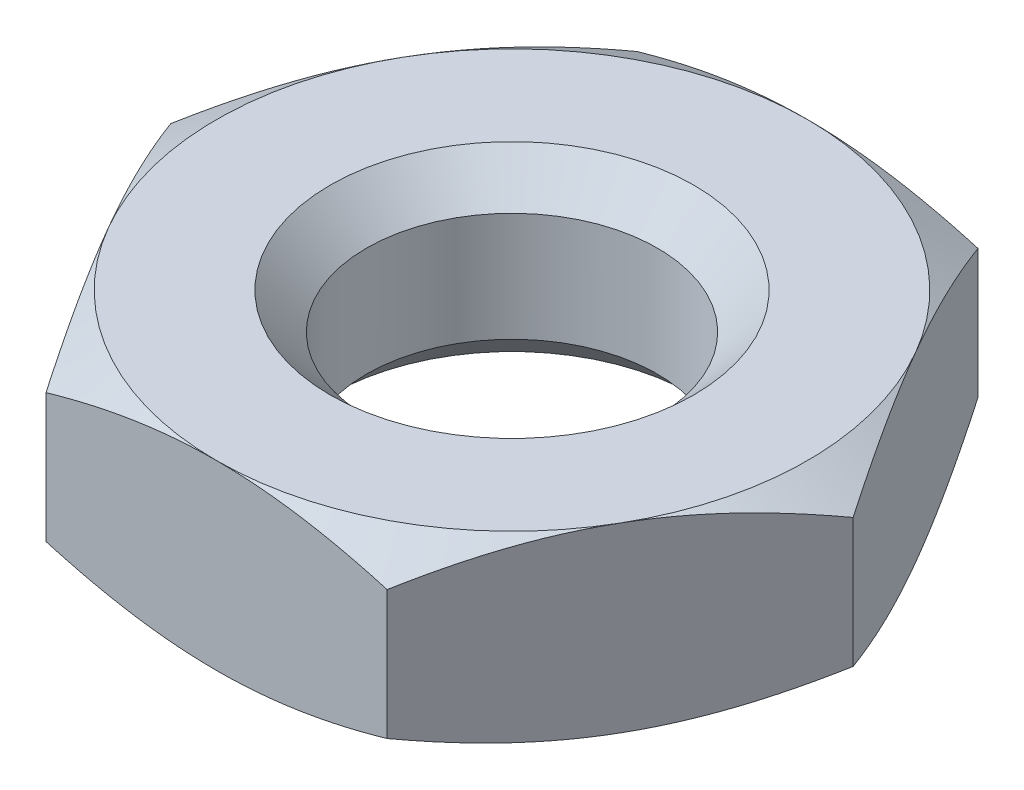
ISO-10303-21;
HEADER;
FILE_DESCRIPTION(('STEP AP214'),'2;1');
FILE_NAME('part.step','',(''),(''),'','','');
FILE_SCHEMA(('AUTOMOTIVE_DESIGN { 1 0 10303 214 1 1 1 1 }'));
ENDSEC;
DATA;
#1=APPLICATION_CONTEXT('core data for automotive mechanical design processes');
#2=APPLICATION_PROTOCOL_DEFINITION('international standard','automotive_design',2000,#1);
#3=PRODUCT_CONTEXT('',#1,'mechanical');
#4=PRODUCT('Part','Part','',(#3));
#5=PRODUCT_RELATED_PRODUCT_CATEGORY('part','',(#4));
#6=PRODUCT_DEFINITION_FORMATION('','',#4);
#7=PRODUCT_DEFINITION_CONTEXT('part definition',#1,'design');
#8=PRODUCT_DEFINITION('design','',#6,#7);
#9=PRODUCT_DEFINITION_SHAPE('','',#8);
#10=(LENGTH_UNIT() NAMED_UNIT(*) SI_UNIT(.MILLI.,.METRE.));
#11=(NAMED_UNIT(*) PLANE_ANGLE_UNIT() SI_UNIT($,.RADIAN.));
#12=(NAMED_UNIT(*) SI_UNIT($,.STERADIAN.) SOLID_ANGLE_UNIT());
#13=UNCERTAINTY_MEASURE_WITH_UNIT(LENGTH_MEASURE(1.E-05),#10,'distance_accuracy_value','');
#14=(GEOMETRIC_REPRESENTATION_CONTEXT(3) GLOBAL_UNCERTAINTY_ASSIGNED_CONTEXT((#13)) GLOBAL_UNIT_ASSIGNED_CONTEXT((#10,
#11,#12)) REPRESENTATION_CONTEXT('',''));
#15=CARTESIAN_POINT('',(0.,0.,0.));
#16=DIRECTION('',(0.,0.,1.));
#17=DIRECTION('',(1.,0.,0.));
#18=AXIS2_PLACEMENT_3D('',#15,#16,#17);
#19=CARTESIAN_POINT('',(0.,0.,0.));
#20=DIRECTION('',(0.,1.,0.));
#21=DIRECTION('',(-1.,0.,0.));
#22=AXIS2_PLACEMENT_3D('',#19,#20,#21);
#23=CONICAL_SURFACE('',#22,6.5,1.04719754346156);
#24=CARTESIAN_POINT('',(7.50566896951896,0.580623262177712,0.000200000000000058));
#25=CARTESIAN_POINT('',(7.42317862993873,0.533004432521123,-0.14267745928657));
#26=CARTESIAN_POINT('',(7.34038072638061,0.487546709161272,-0.286087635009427));
#27=CARTESIAN_POINT('',(7.17411251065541,0.401548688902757,-0.57407263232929));
#28=CARTESIAN_POINT('',(7.09064192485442,0.361010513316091,-0.718647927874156));
#29=CARTESIAN_POINT('',(6.83889369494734,0.247571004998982,-1.15468865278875));
#30=CARTESIAN_POINT('',(6.66962231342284,0.183047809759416,-1.44787528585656));
#31=CARTESIAN_POINT('',(6.41631076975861,0.107386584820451,-1.8866237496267));
#32=CARTESIAN_POINT('',(6.33302747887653,0.0858328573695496,-2.03087464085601));
#33=CARTESIAN_POINT('',(6.16608458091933,0.0496903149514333,-2.32002822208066));
#34=CARTESIAN_POINT('',(6.08242500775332,0.0351008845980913,-2.46493085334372));
#35=CARTESIAN_POINT('',(5.91496056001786,0.0132587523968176,-2.754987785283));
#36=CARTESIAN_POINT('',(5.83115595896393,0.00599772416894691,-2.90014161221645));
#37=CARTESIAN_POINT('',(5.66347396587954,-0.00103969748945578,-3.19057534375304));
#38=CARTESIAN_POINT('',(5.57959657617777,-0.000816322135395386,-3.33585524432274));
#39=CARTESIAN_POINT('',(5.34979921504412,0.0100834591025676,-3.73387594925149));
#40=CARTESIAN_POINT('',(5.20395446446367,0.0283818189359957,-3.98648646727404));
#41=CARTESIAN_POINT('',(4.91323365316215,0.0864063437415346,-4.49002968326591));
#42=CARTESIAN_POINT('',(4.76835861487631,0.126152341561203,-4.74096061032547));
#43=CARTESIAN_POINT('',(4.47705271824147,0.225505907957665,-5.24551722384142));
#44=CARTESIAN_POINT('',(4.33065861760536,0.285534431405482,-5.49907924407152));
#45=CARTESIAN_POINT('',(4.04005357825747,0.421775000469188,-6.00242193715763));
#46=CARTESIAN_POINT('',(3.89583891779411,0.497955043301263,-6.25220905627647));
#47=CARTESIAN_POINT('',(3.75266127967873,0.580623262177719,-6.5002));
#48=B_SPLINE_CURVE_WITH_KNOTS('',3,(#24,#25,#26,#27,#28,#29,#30,#31,#32,#33,#34,#35,#36,#37,#38,
#39,#40,#41,#42,#43,#44,#45,#46,#47),.UNSPECIFIED.,.F.,.F.,(4,2,2,2,2,2,2,2,2,2,2,4),(0.,
0.515105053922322,1.03043143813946,2.06322555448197,2.56697390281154,3.0706777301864,
3.57380861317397,4.0769239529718,4.95279355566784,5.82947447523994,6.72559912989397,
7.61996451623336),.UNSPECIFIED.);
#49=CARTESIAN_POINT('',(7.50555349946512,0.580556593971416,0.));
#50=VERTEX_POINT('',#49);
#51=CARTESIAN_POINT('',(5.62916512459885,0.,-3.24999999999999));
#52=VERTEX_POINT('',#51);
#53=EDGE_CURVE('E287',#50,#52,#48,.T.);
#54=ORIENTED_EDGE('',*,*,#53,.F.);
#55=CARTESIAN_POINT('',(3.75266127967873,0.580623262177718,6.5002));
#56=CARTESIAN_POINT('',(3.83515161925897,0.533004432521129,6.35732254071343));
#57=CARTESIAN_POINT('',(3.91794952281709,0.487546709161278,6.21391236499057));
#58=CARTESIAN_POINT('',(4.08421773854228,0.401548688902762,5.92592736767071));
#59=CARTESIAN_POINT('',(4.16768832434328,0.361010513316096,5.78135207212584));
#60=CARTESIAN_POINT('',(4.41943655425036,0.247571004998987,5.34531134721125));
#61=CARTESIAN_POINT('',(4.58870793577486,0.183047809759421,5.05212471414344));
#62=CARTESIAN_POINT('',(4.84201947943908,0.107386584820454,4.6133762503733));
#63=CARTESIAN_POINT('',(4.92530277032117,0.0858328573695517,4.46912535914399));
#64=CARTESIAN_POINT('',(5.09224566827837,0.0496903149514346,4.17997177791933));
#65=CARTESIAN_POINT('',(5.17590524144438,0.0351008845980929,4.03506914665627));
#66=CARTESIAN_POINT('',(5.34336968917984,0.013258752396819,3.74501221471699));
#67=CARTESIAN_POINT('',(5.42717429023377,0.00599772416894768,3.59985838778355));
#68=CARTESIAN_POINT('',(5.59485628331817,-0.0010396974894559,3.30942465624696));
#69=CARTESIAN_POINT('',(5.67873367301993,-0.000816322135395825,3.16414475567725));
#70=CARTESIAN_POINT('',(5.90853103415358,0.0100834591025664,2.76612405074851));
#71=CARTESIAN_POINT('',(6.05437578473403,0.0283818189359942,2.51351353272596));
#72=CARTESIAN_POINT('',(6.34509659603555,0.0864063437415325,2.00997031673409));
#73=CARTESIAN_POINT('',(6.48997163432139,0.1261523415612,1.75903938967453));
#74=CARTESIAN_POINT('',(6.78127753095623,0.225505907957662,1.25448277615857));
#75=CARTESIAN_POINT('',(6.92767163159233,0.285534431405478,1.00092075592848));
#76=CARTESIAN_POINT('',(7.21827667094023,0.421775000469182,0.49757806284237));
#77=CARTESIAN_POINT('',(7.36249133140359,0.497955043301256,0.247790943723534));
#78=CARTESIAN_POINT('',(7.50566896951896,0.580623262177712,-0.00020000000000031));
#79=B_SPLINE_CURVE_WITH_KNOTS('',3,(#55,#56,#57,#58,#59,#60,#61,#62,#63,#64,#65,#66,#67,#68,#69,
#70,#71,#72,#73,#74,#75,#76,#77,#78),.UNSPECIFIED.,.F.,.F.,(4,2,2,2,2,2,2,2,2,2,2,4),(0.,
0.515105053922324,1.03043143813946,2.06322555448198,2.56697390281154,3.07067773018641,
3.57380861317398,4.07692395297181,4.95279355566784,5.82947447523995,6.72559912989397,
7.61996451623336),.UNSPECIFIED.);
#80=CARTESIAN_POINT('',(5.62916512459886,0.,3.24999999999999));
#81=VERTEX_POINT('',#80);
#82=EDGE_CURVE('E157',#81,#50,#79,.T.);
#83=ORIENTED_EDGE('',*,*,#82,.F.);
#84=CARTESIAN_POINT('',(0.,0.,0.));
#85=DIRECTION('',(0.,1.,0.));
#86=DIRECTION('',(-1.,0.,0.));
#87=AXIS2_PLACEMENT_3D('',#84,#85,#86);
#88=CIRCLE('',#87,6.5);
#89=EDGE_CURVE('E263',#81,#52,#88,.T.);
#90=ORIENTED_EDGE('',*,*,#89,.T.);
#91=EDGE_LOOP('',(#54,#83,#90));
#92=FACE_BOUND('',#91,.T.);
#93=ADVANCED_FACE('F37',(#92),#23,.T.);
#94=CARTESIAN_POINT('',(3.75277674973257,0.580556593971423,-6.5));
#95=VERTEX_POINT('',#94);
#96=EDGE_CURVE('E291',#52,#95,#48,.T.);
#97=ORIENTED_EDGE('',*,*,#96,.F.);
#98=CARTESIAN_POINT('',(0.,0.,-6.5));
#99=VERTEX_POINT('',#98);
#100=EDGE_CURVE('E279',#52,#99,#88,.T.);
#101=ORIENTED_EDGE('',*,*,#100,.T.);
#102=CARTESIAN_POINT('',(-10.0886341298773,3.17616114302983,-6.5));
#103=CARTESIAN_POINT('',(-9.80467347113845,3.03838174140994,-6.5));
#104=CARTESIAN_POINT('',(-9.52006185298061,2.90192102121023,-6.5));
#105=CARTESIAN_POINT('',(-8.94919057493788,2.63237840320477,-6.5));
#106=CARTESIAN_POINT('',(-8.66293066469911,2.49929703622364,-6.5));
#107=CARTESIAN_POINT('',(-8.08694567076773,2.23658679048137,-6.5));
#108=CARTESIAN_POINT('',(-7.79721021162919,2.10698058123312,-6.5));
#109=CARTESIAN_POINT('',(-7.21543776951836,1.85306089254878,-6.5));
#110=CARTESIAN_POINT('',(-6.92340089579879,1.72874716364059,-6.5));
#111=CARTESIAN_POINT('',(-6.32709030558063,1.48290474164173,-6.5));
#112=CARTESIAN_POINT('',(-6.02272573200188,1.36159523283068,-6.5));
#113=CARTESIAN_POINT('',(-5.41043841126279,1.12813757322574,-6.5));
#114=CARTESIAN_POINT('',(-5.10251526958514,1.01599044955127,-6.5));
#115=CARTESIAN_POINT('',(-4.48319586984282,0.803795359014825,-6.5));
#116=CARTESIAN_POINT('',(-4.17180806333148,0.703722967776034,-6.5));
#117=CARTESIAN_POINT('',(-3.54456226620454,0.518884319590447,-6.5));
#118=CARTESIAN_POINT('',(-3.22870571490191,0.43411325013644,-6.5));
#119=CARTESIAN_POINT('',(-2.59412088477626,0.284389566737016,-6.5));
#120=CARTESIAN_POINT('',(-2.27541854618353,0.219328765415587,-6.5));
#121=CARTESIAN_POINT('',(-1.6339965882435,0.112709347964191,-6.5));
#122=CARTESIAN_POINT('',(-1.31127735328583,0.0711485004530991,-6.5));
#123=CARTESIAN_POINT('',(-0.827615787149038,0.0291913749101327,-6.5));
#124=CARTESIAN_POINT('',(-0.667517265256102,0.0186073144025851,-6.5));
#125=CARTESIAN_POINT('',(-0.347008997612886,0.0042135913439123,-6.5));
#126=CARTESIAN_POINT('',(-0.186599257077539,0.000403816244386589,-6.5));
#127=CARTESIAN_POINT('',(0.134235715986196,-0.000342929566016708,-6.5));
#128=CARTESIAN_POINT('',(0.294660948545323,0.00272011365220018,-6.5));
#129=CARTESIAN_POINT('',(0.615239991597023,0.0156420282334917,-6.5));
#130=CARTESIAN_POINT('',(0.775393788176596,0.0255012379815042,-6.5));
#131=CARTESIAN_POINT('',(1.16005135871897,0.0571346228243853,-6.5));
#132=CARTESIAN_POINT('',(1.38429656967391,0.0821202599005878,-6.5));
#133=CARTESIAN_POINT('',(1.83111748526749,0.144054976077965,-6.5));
#134=CARTESIAN_POINT('',(2.05369295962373,0.181005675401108,-6.5));
#135=CARTESIAN_POINT('',(2.71866392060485,0.307845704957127,-6.5));
#136=CARTESIAN_POINT('',(3.15805420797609,0.413699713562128,-6.5));
#137=CARTESIAN_POINT('',(3.81504917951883,0.597194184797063,-6.5));
#138=CARTESIAN_POINT('',(4.03606361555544,0.663327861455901,-6.5));
#139=CARTESIAN_POINT('',(4.47594587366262,0.802449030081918,-6.5));
#140=CARTESIAN_POINT('',(4.69481368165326,0.875436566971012,-6.5));
#141=CARTESIAN_POINT('',(5.13047157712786,1.02709568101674,-6.5));
#142=CARTESIAN_POINT('',(5.34726232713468,1.10576537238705,-6.5));
#143=CARTESIAN_POINT('',(5.77904891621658,1.26786470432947,-6.5));
#144=CARTESIAN_POINT('',(5.99404477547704,1.35129429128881,-6.5));
#145=CARTESIAN_POINT('',(6.49787787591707,1.55220480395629,-6.5));
#146=CARTESIAN_POINT('',(6.78605773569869,1.67133113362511,-6.5));
#147=CARTESIAN_POINT('',(7.35998859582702,1.9153142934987,-6.5));
#148=CARTESIAN_POINT('',(7.64573945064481,2.04017146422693,-6.5));
#149=CARTESIAN_POINT('',(8.21525357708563,2.29447640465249,-6.5));
#150=CARTESIAN_POINT('',(8.49901644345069,2.42392507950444,-6.5));
#151=CARTESIAN_POINT('',(9.06483728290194,2.68650288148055,-6.5));
#152=CARTESIAN_POINT('',(9.34689521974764,2.81963208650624,-6.5));
#153=CARTESIAN_POINT('',(9.90987348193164,3.0890251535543,-6.5));
#154=CARTESIAN_POINT('',(10.1907922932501,3.22529217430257,-6.5));
#155=CARTESIAN_POINT('',(10.7514192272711,3.50029662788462,-6.5));
#156=CARTESIAN_POINT('',(11.0311273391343,3.63903408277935,-6.5));
#157=CARTESIAN_POINT('',(11.868649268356,4.05826371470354,-6.5));
#158=CARTESIAN_POINT('',(12.4249347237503,4.34180888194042,-6.5));
#159=CARTESIAN_POINT('',(13.4885089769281,4.89087824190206,-6.5));
#160=CARTESIAN_POINT('',(13.9960343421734,5.15594623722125,-6.5));
#161=CARTESIAN_POINT('',(15.0091848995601,5.68972878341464,-6.5));
#162=CARTESIAN_POINT('',(15.5148100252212,5.95844346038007,-6.5));
#163=CARTESIAN_POINT('',(16.5233283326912,6.49798637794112,-6.5));
#164=CARTESIAN_POINT('',(17.0262251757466,6.76880778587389,-6.5));
#165=CARTESIAN_POINT('',(18.0308016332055,7.31263450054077,-6.5));
#166=CARTESIAN_POINT('',(18.5324813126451,7.58563968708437,-6.5));
#167=CARTESIAN_POINT('',(19.0337120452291,7.85946110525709,-6.5));
#168=B_SPLINE_CURVE_WITH_KNOTS('',3,(#102,#103,#104,#105,#106,#107,#108,#109,#110,#111,#112,
#113,#114,#115,#116,#117,#118,#119,#120,#121,#122,#123,#124,#125,#126,#127,#128,#129,#130,#131,
#132,#133,#134,#135,#136,#137,#138,#139,#140,#141,#142,#143,#144,#145,#146,#147,#148,#149,#150,
#151,#152,#153,#154,#155,#156,#157,#158,#159,#160,#161,#162,#163,#164,#165,#166,#167),
.UNSPECIFIED.,.F.,.F.,(4,2,2,2,2,2,2,2,2,2,2,2,2,2,2,2,2,2,2,2,2,2,2,2,2,2,2,2,2,2,2,2,4),(0.,
0.946875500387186,1.89389882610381,2.84606421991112,3.7981846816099,4.78101744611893,
5.76396023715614,6.74488019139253,7.72549109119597,8.70061771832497,9.67565173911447,
10.1568741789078,10.6380886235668,11.1193040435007,11.6005434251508,12.2770600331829,
12.9536682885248,14.3076338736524,14.9996668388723,15.691704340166,16.3835132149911,
17.0753142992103,18.0107248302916,18.9461910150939,19.8818426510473,20.8175141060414,
21.754172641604,22.6908395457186,24.5639267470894,26.2816383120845,27.9994094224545,
29.7129512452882,31.4263993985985),.UNSPECIFIED.);
#169=EDGE_CURVE('E343',#95,#99,#168,.F.);
#170=ORIENTED_EDGE('',*,*,#169,.F.);
#171=EDGE_LOOP('',(#97,#101,#170));
#172=FACE_BOUND('',#171,.T.);
#173=ADVANCED_FACE('F317',(#172),#23,.T.);
#174=CARTESIAN_POINT('',(-3.75277674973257,0.580556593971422,-6.5));
#175=VERTEX_POINT('',#174);
#176=EDGE_CURVE('E215',#99,#175,#168,.F.);
#177=ORIENTED_EDGE('',*,*,#176,.F.);
#178=CARTESIAN_POINT('',(-5.62916512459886,0.,-3.24999999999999));
#179=VERTEX_POINT('',#178);
#180=EDGE_CURVE('E273',#99,#179,#88,.T.);
#181=ORIENTED_EDGE('',*,*,#180,.T.);
#182=CARTESIAN_POINT('',(-3.75266127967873,0.580623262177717,-6.5002));
#183=CARTESIAN_POINT('',(-3.83515161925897,0.533004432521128,-6.35732254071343));
#184=CARTESIAN_POINT('',(-3.91794952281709,0.487546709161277,-6.21391236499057));
#185=CARTESIAN_POINT('',(-4.08421773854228,0.401548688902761,-5.92592736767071));
#186=CARTESIAN_POINT('',(-4.16768832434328,0.361010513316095,-5.78135207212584));
#187=CARTESIAN_POINT('',(-4.41943655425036,0.247571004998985,-5.34531134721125));
#188=CARTESIAN_POINT('',(-4.58870793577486,0.183047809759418,-5.05212471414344));
#189=CARTESIAN_POINT('',(-4.84201947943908,0.107386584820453,-4.6133762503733));
#190=CARTESIAN_POINT('',(-4.92530277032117,0.0858328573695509,-4.46912535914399));
#191=CARTESIAN_POINT('',(-5.09224566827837,0.0496903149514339,-4.17997177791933));
#192=CARTESIAN_POINT('',(-5.17590524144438,0.0351008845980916,-4.03506914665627));
#193=CARTESIAN_POINT('',(-5.34336968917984,0.013258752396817,-3.74501221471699));
#194=CARTESIAN_POINT('',(-5.42717429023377,0.00599772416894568,-3.59985838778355));
#195=CARTESIAN_POINT('',(-5.59485628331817,-0.00103969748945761,-3.30942465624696));
#196=CARTESIAN_POINT('',(-5.67873367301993,-0.000816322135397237,-3.16414475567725));
#197=CARTESIAN_POINT('',(-5.90853103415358,0.0100834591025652,-2.76612405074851));
#198=CARTESIAN_POINT('',(-6.05437578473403,0.0283818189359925,-2.51351353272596));
#199=CARTESIAN_POINT('',(-6.34509659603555,0.0864063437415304,-2.00997031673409));
#200=CARTESIAN_POINT('',(-6.48997163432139,0.126152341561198,-1.75903938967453));
#201=CARTESIAN_POINT('',(-6.78127753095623,0.22550590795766,-1.25448277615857));
#202=CARTESIAN_POINT('',(-6.92767163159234,0.285534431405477,-1.00092075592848));
#203=CARTESIAN_POINT('',(-7.21827667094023,0.42177500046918,-0.497578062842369));
#204=CARTESIAN_POINT('',(-7.36249133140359,0.497955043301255,-0.247790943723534));
#205=CARTESIAN_POINT('',(-7.50566896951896,0.58062326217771,0.000200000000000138));
#206=B_SPLINE_CURVE_WITH_KNOTS('',3,(#182,#183,#184,#185,#186,#187,#188,#189,#190,#191,#192,
#193,#194,#195,#196,#197,#198,#199,#200,#201,#202,#203,#204,#205),.UNSPECIFIED.,.F.,.F.,(4,2,2,
2,2,2,2,2,2,2,2,4),(0.,0.515105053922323,1.03043143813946,2.06322555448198,2.56697390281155,
3.07067773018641,3.57380861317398,4.07692395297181,4.95279355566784,5.82947447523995,
6.72559912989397,7.61996451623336),.UNSPECIFIED.);
#207=EDGE_CURVE('E210',#175,#179,#206,.T.);
#208=ORIENTED_EDGE('',*,*,#207,.F.);
#209=EDGE_LOOP('',(#177,#181,#208));
#210=FACE_BOUND('',#209,.T.);
#211=ADVANCED_FACE('F322',(#210),#23,.T.);
#212=CARTESIAN_POINT('',(-7.50555349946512,0.580556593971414,0.));
#213=VERTEX_POINT('',#212);
#214=EDGE_CURVE('E211',#179,#213,#206,.T.);
#215=ORIENTED_EDGE('',*,*,#214,.F.);
#216=CARTESIAN_POINT('',(-5.62916512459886,0.,3.24999999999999));
#217=VERTEX_POINT('',#216);
#218=EDGE_CURVE('E268',#179,#217,#88,.T.);
#219=ORIENTED_EDGE('',*,*,#218,.T.);
#220=CARTESIAN_POINT('',(-7.50566896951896,0.58062326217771,-0.0002));
#221=CARTESIAN_POINT('',(-7.42317862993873,0.533004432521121,0.142677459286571));
#222=CARTESIAN_POINT('',(-7.34038072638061,0.48754670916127,0.286087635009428));
#223=CARTESIAN_POINT('',(-7.17411251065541,0.401548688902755,0.574072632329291));
#224=CARTESIAN_POINT('',(-7.09064192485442,0.361010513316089,0.718647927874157));
#225=CARTESIAN_POINT('',(-6.83889369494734,0.247571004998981,1.15468865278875));
#226=CARTESIAN_POINT('',(-6.66962231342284,0.183047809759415,1.44787528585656));
#227=CARTESIAN_POINT('',(-6.41631076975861,0.107386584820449,1.8866237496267));
#228=CARTESIAN_POINT('',(-6.33302747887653,0.0858328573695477,2.03087464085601));
#229=CARTESIAN_POINT('',(-6.16608458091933,0.0496903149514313,2.32002822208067));
#230=CARTESIAN_POINT('',(-6.08242500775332,0.0351008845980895,2.46493085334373));
#231=CARTESIAN_POINT('',(-5.91496056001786,0.0132587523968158,2.75498778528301));
#232=CARTESIAN_POINT('',(-5.83115595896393,0.00599772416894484,2.90014161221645));
#233=CARTESIAN_POINT('',(-5.66347396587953,-0.00103969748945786,3.19057534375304));
#234=CARTESIAN_POINT('',(-5.57959657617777,-0.000816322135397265,3.33585524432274));
#235=CARTESIAN_POINT('',(-5.34979921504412,0.0100834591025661,3.73387594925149));
#236=CARTESIAN_POINT('',(-5.20395446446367,0.0283818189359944,3.98648646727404));
#237=CARTESIAN_POINT('',(-4.91323365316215,0.0864063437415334,4.49002968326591));
#238=CARTESIAN_POINT('',(-4.76835861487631,0.126152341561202,4.74096061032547));
#239=CARTESIAN_POINT('',(-4.47705271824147,0.225505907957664,5.24551722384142));
#240=CARTESIAN_POINT('',(-4.33065861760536,0.285534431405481,5.49907924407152));
#241=CARTESIAN_POINT('',(-4.04005357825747,0.421775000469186,6.00242193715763));
#242=CARTESIAN_POINT('',(-3.89583891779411,0.497955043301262,6.25220905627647));
#243=CARTESIAN_POINT('',(-3.75266127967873,0.580623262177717,6.5002));
#244=B_SPLINE_CURVE_WITH_KNOTS('',3,(#220,#221,#222,#223,#224,#225,#226,#227,#228,#229,#230,
#231,#232,#233,#234,#235,#236,#237,#238,#239,#240,#241,#242,#243),.UNSPECIFIED.,.F.,.F.,(4,2,2,
2,2,2,2,2,2,2,2,4),(0.,0.515105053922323,1.03043143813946,2.06322555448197,2.56697390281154,
3.0706777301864,3.57380861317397,4.0769239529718,4.95279355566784,5.82947447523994,
6.72559912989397,7.61996451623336),.UNSPECIFIED.);
#245=EDGE_CURVE('E239',#213,#217,#244,.T.);
#246=ORIENTED_EDGE('',*,*,#245,.F.);
#247=EDGE_LOOP('',(#215,#219,#246));
#248=FACE_BOUND('',#247,.T.);
#249=ADVANCED_FACE('F328',(#248),#23,.T.);
#250=CARTESIAN_POINT('',(-3.75277674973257,0.580556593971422,6.5));
#251=VERTEX_POINT('',#250);
#252=EDGE_CURVE('E235',#217,#251,#244,.T.);
#253=ORIENTED_EDGE('',*,*,#252,.F.);
#254=CARTESIAN_POINT('',(0.,0.,6.5));
#255=VERTEX_POINT('',#254);
#256=EDGE_CURVE('E260',#217,#255,#88,.T.);
#257=ORIENTED_EDGE('',*,*,#256,.T.);
#258=CARTESIAN_POINT('',(-10.0886341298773,3.17616114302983,6.5));
#259=CARTESIAN_POINT('',(-9.80467347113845,3.03838174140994,6.5));
#260=CARTESIAN_POINT('',(-9.52006185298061,2.90192102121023,6.5));
#261=CARTESIAN_POINT('',(-8.94919057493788,2.63237840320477,6.5));
#262=CARTESIAN_POINT('',(-8.66293066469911,2.49929703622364,6.5));
#263=CARTESIAN_POINT('',(-8.08694567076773,2.23658679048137,6.5));
#264=CARTESIAN_POINT('',(-7.79721021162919,2.10698058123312,6.5));
#265=CARTESIAN_POINT('',(-7.21543776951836,1.85306089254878,6.5));
#266=CARTESIAN_POINT('',(-6.92340089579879,1.72874716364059,6.5));
#267=CARTESIAN_POINT('',(-6.32709030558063,1.48290474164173,6.5));
#268=CARTESIAN_POINT('',(-6.02272573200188,1.36159523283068,6.5));
#269=CARTESIAN_POINT('',(-5.41043841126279,1.12813757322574,6.5));
#270=CARTESIAN_POINT('',(-5.10251526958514,1.01599044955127,6.5));
#271=CARTESIAN_POINT('',(-4.48319586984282,0.803795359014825,6.5));
#272=CARTESIAN_POINT('',(-4.17180806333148,0.703722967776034,6.5));
#273=CARTESIAN_POINT('',(-3.54456226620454,0.518884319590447,6.5));
#274=CARTESIAN_POINT('',(-3.22870571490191,0.43411325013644,6.5));
#275=CARTESIAN_POINT('',(-2.59412088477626,0.284389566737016,6.5));
#276=CARTESIAN_POINT('',(-2.27541854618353,0.219328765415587,6.5));
#277=CARTESIAN_POINT('',(-1.6339965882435,0.112709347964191,6.5));
#278=CARTESIAN_POINT('',(-1.31127735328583,0.0711485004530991,6.5));
#279=CARTESIAN_POINT('',(-0.827615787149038,0.0291913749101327,6.5));
#280=CARTESIAN_POINT('',(-0.667517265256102,0.0186073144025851,6.5));
#281=CARTESIAN_POINT('',(-0.347008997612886,0.0042135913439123,6.5));
#282=CARTESIAN_POINT('',(-0.186599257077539,0.000403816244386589,6.5));
#283=CARTESIAN_POINT('',(0.134235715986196,-0.000342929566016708,6.5));
#284=CARTESIAN_POINT('',(0.294660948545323,0.00272011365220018,6.5));
#285=CARTESIAN_POINT('',(0.615239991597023,0.0156420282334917,6.5));
#286=CARTESIAN_POINT('',(0.775393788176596,0.0255012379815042,6.5));
#287=CARTESIAN_POINT('',(1.16005135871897,0.0571346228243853,6.5));
#288=CARTESIAN_POINT('',(1.38429656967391,0.0821202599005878,6.5));
#289=CARTESIAN_POINT('',(1.83111748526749,0.144054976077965,6.5));
#290=CARTESIAN_POINT('',(2.05369295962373,0.181005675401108,6.5));
#291=CARTESIAN_POINT('',(2.71866392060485,0.307845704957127,6.5));
#292=CARTESIAN_POINT('',(3.15805420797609,0.413699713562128,6.5));
#293=CARTESIAN_POINT('',(3.81504917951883,0.597194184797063,6.5));
#294=CARTESIAN_POINT('',(4.03606361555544,0.663327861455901,6.5));
#295=CARTESIAN_POINT('',(4.47594587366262,0.802449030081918,6.5));
#296=CARTESIAN_POINT('',(4.69481368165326,0.875436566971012,6.5));
#297=CARTESIAN_POINT('',(5.13047157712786,1.02709568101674,6.5));
#298=CARTESIAN_POINT('',(5.34726232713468,1.10576537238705,6.5));
#299=CARTESIAN_POINT('',(5.77904891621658,1.26786470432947,6.5));
#300=CARTESIAN_POINT('',(5.99404477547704,1.35129429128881,6.5));
#301=CARTESIAN_POINT('',(6.49787787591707,1.55220480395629,6.5));
#302=CARTESIAN_POINT('',(6.78605773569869,1.67133113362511,6.5));
#303=CARTESIAN_POINT('',(7.35998859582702,1.9153142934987,6.5));
#304=CARTESIAN_POINT('',(7.64573945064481,2.04017146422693,6.5));
#305=CARTESIAN_POINT('',(8.21525357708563,2.29447640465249,6.5));
#306=CARTESIAN_POINT('',(8.49901644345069,2.42392507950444,6.5));
#307=CARTESIAN_POINT('',(9.06483728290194,2.68650288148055,6.5));
#308=CARTESIAN_POINT('',(9.34689521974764,2.81963208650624,6.5));
#309=CARTESIAN_POINT('',(9.90987348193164,3.0890251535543,6.5));
#310=CARTESIAN_POINT('',(10.1907922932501,3.22529217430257,6.5));
#311=CARTESIAN_POINT('',(10.7514192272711,3.50029662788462,6.5));
#312=CARTESIAN_POINT('',(11.0311273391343,3.63903408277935,6.5));
#313=CARTESIAN_POINT('',(11.868649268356,4.05826371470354,6.5));
#314=CARTESIAN_POINT('',(12.4249347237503,4.34180888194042,6.5));
#315=CARTESIAN_POINT('',(13.4885089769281,4.89087824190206,6.5));
#316=CARTESIAN_POINT('',(13.9960343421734,5.15594623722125,6.5));
#317=CARTESIAN_POINT('',(15.0091848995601,5.68972878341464,6.5));
#318=CARTESIAN_POINT('',(15.5148100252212,5.95844346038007,6.5));
#319=CARTESIAN_POINT('',(16.5233283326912,6.49798637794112,6.5));
#320=CARTESIAN_POINT('',(17.0262251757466,6.76880778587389,6.5));
#321=CARTESIAN_POINT('',(18.0308016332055,7.31263450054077,6.5));
#322=CARTESIAN_POINT('',(18.5324813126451,7.58563968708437,6.5));
#323=CARTESIAN_POINT('',(19.0337120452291,7.85946110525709,6.5));
#324=B_SPLINE_CURVE_WITH_KNOTS('',3,(#258,#259,#260,#261,#262,#263,#264,#265,#266,#267,#268,
#269,#270,#271,#272,#273,#274,#275,#276,#277,#278,#279,#280,#281,#282,#283,#284,#285,#286,#287,
#288,#289,#290,#291,#292,#293,#294,#295,#296,#297,#298,#299,#300,#301,#302,#303,#304,#305,#306,
#307,#308,#309,#310,#311,#312,#313,#314,#315,#316,#317,#318,#319,#320,#321,#322,#323),
.UNSPECIFIED.,.F.,.F.,(4,2,2,2,2,2,2,2,2,2,2,2,2,2,2,2,2,2,2,2,2,2,2,2,2,2,2,2,2,2,2,2,4),(0.,
0.946875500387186,1.89389882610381,2.84606421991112,3.7981846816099,4.78101744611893,
5.76396023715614,6.74488019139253,7.72549109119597,8.70061771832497,9.67565173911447,
10.1568741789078,10.6380886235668,11.1193040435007,11.6005434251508,12.2770600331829,
12.9536682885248,14.3076338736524,14.9996668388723,15.691704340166,16.3835132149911,
17.0753142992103,18.0107248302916,18.9461910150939,19.8818426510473,20.8175141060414,
21.754172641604,22.6908395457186,24.5639267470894,26.2816383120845,27.9994094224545,
29.7129512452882,31.4263993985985),.UNSPECIFIED.);
#325=EDGE_CURVE('E149',#251,#255,#324,.T.);
#326=ORIENTED_EDGE('',*,*,#325,.F.);
#327=EDGE_LOOP('',(#253,#257,#326));
#328=FACE_BOUND('',#327,.T.);
#329=ADVANCED_FACE('F265',(#328),#23,.T.);
#330=CARTESIAN_POINT('',(3.75277674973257,0.580556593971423,6.5));
#331=VERTEX_POINT('',#330);
#332=EDGE_CURVE('E139',#255,#331,#324,.T.);
#333=ORIENTED_EDGE('',*,*,#332,.F.);
#334=EDGE_CURVE('E254',#255,#81,#88,.T.);
#335=ORIENTED_EDGE('',*,*,#334,.T.);
#336=EDGE_CURVE('E52',#331,#81,#79,.T.);
#337=ORIENTED_EDGE('',*,*,#336,.F.);
#338=EDGE_LOOP('',(#333,#335,#337));
#339=FACE_BOUND('',#338,.T.);
#340=ADVANCED_FACE('F174',(#339),#23,.T.);
#341=CARTESIAN_POINT('',(0.,2.44554894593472,0.));
#342=DIRECTION('',(0.,-1.,0.));
#343=DIRECTION('',(1.,0.,0.));
#344=AXIS2_PLACEMENT_3D('',#341,#342,#343);
#345=CONICAL_SURFACE('',#344,9.19238815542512,1.04719754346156);
#346=CARTESIAN_POINT('',(-7.50566896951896,3.41937673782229,0.0002));
#347=CARTESIAN_POINT('',(-7.42317862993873,3.46699556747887,-0.142677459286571));
#348=CARTESIAN_POINT('',(-7.34038072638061,3.51245329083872,-0.286087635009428));
#349=CARTESIAN_POINT('',(-7.17411251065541,3.59845131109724,-0.574072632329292));
#350=CARTESIAN_POINT('',(-7.09064192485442,3.63898948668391,-0.718647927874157));
#351=CARTESIAN_POINT('',(-6.83889369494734,3.75242899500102,-1.15468865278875));
#352=CARTESIAN_POINT('',(-6.66962231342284,3.81695219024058,-1.44787528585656));
#353=CARTESIAN_POINT('',(-6.41631076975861,3.89261341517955,-1.8866237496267));
#354=CARTESIAN_POINT('',(-6.33302747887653,3.91416714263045,-2.03087464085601));
#355=CARTESIAN_POINT('',(-6.16608458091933,3.95030968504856,-2.32002822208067));
#356=CARTESIAN_POINT('',(-6.08242500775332,3.96489911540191,-2.46493085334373));
#357=CARTESIAN_POINT('',(-5.91496056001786,3.98674124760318,-2.75498778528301));
#358=CARTESIAN_POINT('',(-5.83115595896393,3.99400227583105,-2.90014161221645));
#359=CARTESIAN_POINT('',(-5.66347396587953,4.00103969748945,-3.19057534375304));
#360=CARTESIAN_POINT('',(-5.57959657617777,4.00081632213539,-3.33585524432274));
#361=CARTESIAN_POINT('',(-5.34979921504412,3.98991654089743,-3.73387594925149));
#362=CARTESIAN_POINT('',(-5.20395446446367,3.971618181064,-3.98648646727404));
#363=CARTESIAN_POINT('',(-4.91323365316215,3.91359365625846,-4.49002968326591));
#364=CARTESIAN_POINT('',(-4.76835861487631,3.87384765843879,-4.74096061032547));
#365=CARTESIAN_POINT('',(-4.47705271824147,3.77449409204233,-5.24551722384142));
#366=CARTESIAN_POINT('',(-4.33065861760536,3.71446556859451,-5.49907924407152));
#367=CARTESIAN_POINT('',(-4.04005357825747,3.57822499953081,-6.00242193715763));
#368=CARTESIAN_POINT('',(-3.89583891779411,3.50204495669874,-6.25220905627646));
#369=CARTESIAN_POINT('',(-3.75266127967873,3.41937673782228,-6.5002));
#370=B_SPLINE_CURVE_WITH_KNOTS('',3,(#346,#347,#348,#349,#350,#351,#352,#353,#354,#355,#356,
#357,#358,#359,#360,#361,#362,#363,#364,#365,#366,#367,#368,#369),.UNSPECIFIED.,.F.,.F.,(4,2,2,
2,2,2,2,2,2,2,2,4),(0.,0.515105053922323,1.03043143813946,2.06322555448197,2.56697390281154,
3.0706777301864,3.57380861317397,4.0769239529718,4.95279355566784,5.82947447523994,
6.72559912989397,7.61996451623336),.UNSPECIFIED.);
#371=CARTESIAN_POINT('',(-7.50555349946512,3.41944340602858,0.));
#372=VERTEX_POINT('',#371);
#373=CARTESIAN_POINT('',(-5.62916512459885,4.,-3.24999999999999));
#374=VERTEX_POINT('',#373);
#375=EDGE_CURVE('E336',#372,#374,#370,.T.);
#376=ORIENTED_EDGE('',*,*,#375,.F.);
#377=CARTESIAN_POINT('',(-3.75266127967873,3.41937673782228,6.5002));
#378=CARTESIAN_POINT('',(-3.83515161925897,3.46699556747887,6.35732254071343));
#379=CARTESIAN_POINT('',(-3.91794952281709,3.51245329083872,6.21391236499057));
#380=CARTESIAN_POINT('',(-4.08421773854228,3.59845131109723,5.92592736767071));
#381=CARTESIAN_POINT('',(-4.16768832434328,3.6389894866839,5.78135207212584));
#382=CARTESIAN_POINT('',(-4.41943655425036,3.75242899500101,5.34531134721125));
#383=CARTESIAN_POINT('',(-4.58870793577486,3.81695219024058,5.05212471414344));
#384=CARTESIAN_POINT('',(-4.84201947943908,3.89261341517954,4.6133762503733));
#385=CARTESIAN_POINT('',(-4.92530277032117,3.91416714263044,4.46912535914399));
#386=CARTESIAN_POINT('',(-5.09224566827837,3.95030968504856,4.17997177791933));
#387=CARTESIAN_POINT('',(-5.17590524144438,3.9648991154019,4.03506914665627));
#388=CARTESIAN_POINT('',(-5.34336968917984,3.98674124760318,3.74501221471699));
#389=CARTESIAN_POINT('',(-5.42717429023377,3.99400227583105,3.59985838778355));
#390=CARTESIAN_POINT('',(-5.59485628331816,4.00103969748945,3.30942465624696));
#391=CARTESIAN_POINT('',(-5.67873367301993,4.00081632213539,3.16414475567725));
#392=CARTESIAN_POINT('',(-5.90853103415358,3.98991654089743,2.76612405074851));
#393=CARTESIAN_POINT('',(-6.05437578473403,3.971618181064,2.51351353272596));
#394=CARTESIAN_POINT('',(-6.34509659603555,3.91359365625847,2.00997031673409));
#395=CARTESIAN_POINT('',(-6.48997163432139,3.8738476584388,1.75903938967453));
#396=CARTESIAN_POINT('',(-6.78127753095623,3.77449409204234,1.25448277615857));
#397=CARTESIAN_POINT('',(-6.92767163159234,3.71446556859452,1.00092075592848));
#398=CARTESIAN_POINT('',(-7.21827667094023,3.57822499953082,0.49757806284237));
#399=CARTESIAN_POINT('',(-7.36249133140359,3.50204495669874,0.247790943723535));
#400=CARTESIAN_POINT('',(-7.50566896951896,3.41937673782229,-0.000200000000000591));
#401=B_SPLINE_CURVE_WITH_KNOTS('',3,(#377,#378,#379,#380,#381,#382,#383,#384,#385,#386,#387,
#388,#389,#390,#391,#392,#393,#394,#395,#396,#397,#398,#399,#400),.UNSPECIFIED.,.F.,.F.,(4,2,2,
2,2,2,2,2,2,2,2,4),(0.,0.515105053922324,1.03043143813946,2.06322555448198,2.56697390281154,
3.07067773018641,3.57380861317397,4.0769239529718,4.95279355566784,5.82947447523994,
6.72559912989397,7.61996451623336),.UNSPECIFIED.);
#402=CARTESIAN_POINT('',(-5.62916512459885,4.,3.24999999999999));
#403=VERTEX_POINT('',#402);
#404=EDGE_CURVE('E190',#403,#372,#401,.T.);
#405=ORIENTED_EDGE('',*,*,#404,.F.);
#406=CARTESIAN_POINT('',(0.,4.,0.));
#407=DIRECTION('',(0.,1.,0.));
#408=DIRECTION('',(-1.,0.,0.));
#409=AXIS2_PLACEMENT_3D('',#406,#407,#408);
#410=CIRCLE('',#409,6.5);
#411=EDGE_CURVE('E280',#374,#403,#410,.T.);
#412=ORIENTED_EDGE('',*,*,#411,.F.);
#413=EDGE_LOOP('',(#376,#405,#412));
#414=FACE_BOUND('',#413,.T.);
#415=ADVANCED_FACE('F169',(#414),#345,.T.);
#416=CARTESIAN_POINT('',(-3.75277674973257,3.41944340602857,-6.5));
#417=VERTEX_POINT('',#416);
#418=EDGE_CURVE('E196',#374,#417,#370,.T.);
#419=ORIENTED_EDGE('',*,*,#418,.F.);
#420=CARTESIAN_POINT('',(0.,4.,-6.5));
#421=VERTEX_POINT('',#420);
#422=EDGE_CURVE('E286',#421,#374,#410,.T.);
#423=ORIENTED_EDGE('',*,*,#422,.F.);
#424=CARTESIAN_POINT('',(-10.0886341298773,0.823838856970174,-6.5));
#425=CARTESIAN_POINT('',(-9.80467347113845,0.961618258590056,-6.5));
#426=CARTESIAN_POINT('',(-9.52006185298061,1.09807897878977,-6.5));
#427=CARTESIAN_POINT('',(-8.94919057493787,1.36762159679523,-6.5));
#428=CARTESIAN_POINT('',(-8.66293066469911,1.50070296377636,-6.5));
#429=CARTESIAN_POINT('',(-8.08694567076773,1.76341320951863,-6.5));
#430=CARTESIAN_POINT('',(-7.79721021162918,1.89301941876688,-6.5));
#431=CARTESIAN_POINT('',(-7.21543776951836,2.14693910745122,-6.5));
#432=CARTESIAN_POINT('',(-6.92340089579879,2.27125283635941,-6.5));
#433=CARTESIAN_POINT('',(-6.32709030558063,2.51709525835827,-6.5));
#434=CARTESIAN_POINT('',(-6.02272573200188,2.63840476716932,-6.5));
#435=CARTESIAN_POINT('',(-5.41043841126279,2.87186242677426,-6.5));
#436=CARTESIAN_POINT('',(-5.10251526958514,2.98400955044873,-6.5));
#437=CARTESIAN_POINT('',(-4.48319586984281,3.19620464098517,-6.5));
#438=CARTESIAN_POINT('',(-4.17180806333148,3.29627703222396,-6.5));
#439=CARTESIAN_POINT('',(-3.54456226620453,3.48111568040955,-6.5));
#440=CARTESIAN_POINT('',(-3.2287057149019,3.56588674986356,-6.5));
#441=CARTESIAN_POINT('',(-2.59412088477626,3.71561043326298,-6.5));
#442=CARTESIAN_POINT('',(-2.27541854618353,3.78067123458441,-6.5));
#443=CARTESIAN_POINT('',(-1.6339965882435,3.88729065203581,-6.5));
#444=CARTESIAN_POINT('',(-1.31127735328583,3.9288514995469,-6.5));
#445=CARTESIAN_POINT('',(-0.827615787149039,3.97080862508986,-6.5));
#446=CARTESIAN_POINT('',(-0.667517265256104,3.98139268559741,-6.5));
#447=CARTESIAN_POINT('',(-0.347008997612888,3.99578640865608,-6.5));
#448=CARTESIAN_POINT('',(-0.186599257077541,3.99959618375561,-6.5));
#449=CARTESIAN_POINT('',(0.134235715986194,4.00034292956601,-6.5));
#450=CARTESIAN_POINT('',(0.294660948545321,3.9972798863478,-6.5));
#451=CARTESIAN_POINT('',(0.615239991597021,3.98435797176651,-6.5));
#452=CARTESIAN_POINT('',(0.775393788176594,3.97449876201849,-6.5));
#453=CARTESIAN_POINT('',(1.16005135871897,3.94286537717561,-6.5));
#454=CARTESIAN_POINT('',(1.38429656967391,3.91787974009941,-6.5));
#455=CARTESIAN_POINT('',(1.83111748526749,3.85594502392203,-6.5));
#456=CARTESIAN_POINT('',(2.05369295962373,3.81899432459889,-6.5));
#457=CARTESIAN_POINT('',(2.71866392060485,3.69215429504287,-6.5));
#458=CARTESIAN_POINT('',(3.1580542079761,3.58630028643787,-6.5));
#459=CARTESIAN_POINT('',(3.81504917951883,3.40280581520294,-6.5));
#460=CARTESIAN_POINT('',(4.03606361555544,3.3366721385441,-6.5));
#461=CARTESIAN_POINT('',(4.47594587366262,3.19755096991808,-6.5));
#462=CARTESIAN_POINT('',(4.69481368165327,3.12456343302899,-6.5));
#463=CARTESIAN_POINT('',(5.13047157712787,2.97290431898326,-6.5));
#464=CARTESIAN_POINT('',(5.34726232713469,2.89423462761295,-6.5));
#465=CARTESIAN_POINT('',(5.77904891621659,2.73213529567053,-6.5));
#466=CARTESIAN_POINT('',(5.99404477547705,2.64870570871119,-6.5));
#467=CARTESIAN_POINT('',(6.49787787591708,2.44779519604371,-6.5));
#468=CARTESIAN_POINT('',(6.78605773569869,2.32866886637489,-6.5));
#469=CARTESIAN_POINT('',(7.35998859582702,2.0846857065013,-6.5));
#470=CARTESIAN_POINT('',(7.64573945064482,1.95982853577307,-6.5));
#471=CARTESIAN_POINT('',(8.21525357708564,1.70552359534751,-6.5));
#472=CARTESIAN_POINT('',(8.49901644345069,1.57607492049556,-6.5));
#473=CARTESIAN_POINT('',(9.06483728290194,1.31349711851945,-6.5));
#474=CARTESIAN_POINT('',(9.34689521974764,1.18036791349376,-6.5));
#475=CARTESIAN_POINT('',(9.90987348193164,0.910974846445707,-6.5));
#476=CARTESIAN_POINT('',(10.1907922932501,0.774707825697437,-6.5));
#477=CARTESIAN_POINT('',(10.7514192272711,0.49970337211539,-6.5));
#478=CARTESIAN_POINT('',(11.0311273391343,0.360965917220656,-6.5));
#479=CARTESIAN_POINT('',(11.868649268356,-0.058263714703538,-6.5));
#480=CARTESIAN_POINT('',(12.4249347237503,-0.341808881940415,-6.5));
#481=CARTESIAN_POINT('',(13.4885089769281,-0.890878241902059,-6.5));
#482=CARTESIAN_POINT('',(13.9960343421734,-1.15594623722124,-6.5));
#483=CARTESIAN_POINT('',(15.0091848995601,-1.68972878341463,-6.5));
#484=CARTESIAN_POINT('',(15.5148100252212,-1.95844346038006,-6.5));
#485=CARTESIAN_POINT('',(16.5233283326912,-2.49798637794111,-6.5));
#486=CARTESIAN_POINT('',(17.0262251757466,-2.76880778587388,-6.5));
#487=CARTESIAN_POINT('',(18.0308016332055,-3.31263450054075,-6.5));
#488=CARTESIAN_POINT('',(18.5324813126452,-3.58563968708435,-6.5));
#489=CARTESIAN_POINT('',(19.0337120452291,-3.85946110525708,-6.5));
#490=B_SPLINE_CURVE_WITH_KNOTS('',3,(#424,#425,#426,#427,#428,#429,#430,#431,#432,#433,#434,
#435,#436,#437,#438,#439,#440,#441,#442,#443,#444,#445,#446,#447,#448,#449,#450,#451,#452,#453,
#454,#455,#456,#457,#458,#459,#460,#461,#462,#463,#464,#465,#466,#467,#468,#469,#470,#471,#472,
#473,#474,#475,#476,#477,#478,#479,#480,#481,#482,#483,#484,#485,#486,#487,#488,#489),
.UNSPECIFIED.,.F.,.F.,(4,2,2,2,2,2,2,2,2,2,2,2,2,2,2,2,2,2,2,2,2,2,2,2,2,2,2,2,2,2,2,2,4),(0.,
0.946875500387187,1.89389882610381,2.84606421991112,3.7981846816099,4.78101744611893,
5.76396023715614,6.74488019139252,7.72549109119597,8.70061771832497,9.67565173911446,
10.1568741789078,10.6380886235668,11.1193040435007,11.6005434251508,12.2770600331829,
12.9536682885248,14.3076338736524,14.9996668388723,15.691704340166,16.3835132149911,
17.0753142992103,18.0107248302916,18.9461910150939,19.8818426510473,20.8175141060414,
21.754172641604,22.6908395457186,24.5639267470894,26.2816383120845,27.9994094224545,
29.7129512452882,31.4263993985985),.UNSPECIFIED.);
#491=EDGE_CURVE('E209',#417,#421,#490,.T.);
#492=ORIENTED_EDGE('',*,*,#491,.F.);
#493=EDGE_LOOP('',(#419,#423,#492));
#494=FACE_BOUND('',#493,.T.);
#495=ADVANCED_FACE('F173',(#494),#345,.T.);
#496=CARTESIAN_POINT('',(3.75277674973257,3.41944340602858,-6.5));
#497=VERTEX_POINT('',#496);
#498=EDGE_CURVE('E203',#421,#497,#490,.T.);
#499=ORIENTED_EDGE('',*,*,#498,.F.);
#500=CARTESIAN_POINT('',(5.62916512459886,4.,-3.24999999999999));
#501=VERTEX_POINT('',#500);
#502=EDGE_CURVE('E290',#501,#421,#410,.T.);
#503=ORIENTED_EDGE('',*,*,#502,.F.);
#504=CARTESIAN_POINT('',(3.75266127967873,3.41937673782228,-6.5002));
#505=CARTESIAN_POINT('',(3.83515161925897,3.46699556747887,-6.35732254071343));
#506=CARTESIAN_POINT('',(3.91794952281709,3.51245329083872,-6.21391236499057));
#507=CARTESIAN_POINT('',(4.08421773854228,3.59845131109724,-5.92592736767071));
#508=CARTESIAN_POINT('',(4.16768832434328,3.6389894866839,-5.78135207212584));
#509=CARTESIAN_POINT('',(4.41943655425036,3.75242899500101,-5.34531134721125));
#510=CARTESIAN_POINT('',(4.58870793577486,3.81695219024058,-5.05212471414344));
#511=CARTESIAN_POINT('',(4.84201947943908,3.89261341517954,-4.6133762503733));
#512=CARTESIAN_POINT('',(4.92530277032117,3.91416714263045,-4.46912535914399));
#513=CARTESIAN_POINT('',(5.09224566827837,3.95030968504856,-4.17997177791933));
#514=CARTESIAN_POINT('',(5.17590524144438,3.96489911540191,-4.03506914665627));
#515=CARTESIAN_POINT('',(5.34336968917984,3.98674124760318,-3.74501221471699));
#516=CARTESIAN_POINT('',(5.42717429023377,3.99400227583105,-3.59985838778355));
#517=CARTESIAN_POINT('',(5.59485628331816,4.00103969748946,-3.30942465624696));
#518=CARTESIAN_POINT('',(5.67873367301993,4.0008163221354,-3.16414475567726));
#519=CARTESIAN_POINT('',(5.90853103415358,3.98991654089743,-2.76612405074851));
#520=CARTESIAN_POINT('',(6.05437578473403,3.971618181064,-2.51351353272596));
#521=CARTESIAN_POINT('',(6.34509659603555,3.91359365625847,-2.00997031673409));
#522=CARTESIAN_POINT('',(6.48997163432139,3.8738476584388,-1.75903938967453));
#523=CARTESIAN_POINT('',(6.78127753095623,3.77449409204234,-1.25448277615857));
#524=CARTESIAN_POINT('',(6.92767163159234,3.71446556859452,-1.00092075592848));
#525=CARTESIAN_POINT('',(7.21827667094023,3.57822499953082,-0.49757806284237));
#526=CARTESIAN_POINT('',(7.36249133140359,3.50204495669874,-0.247790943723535));
#527=CARTESIAN_POINT('',(7.50566896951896,3.41937673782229,0.000200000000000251));
#528=B_SPLINE_CURVE_WITH_KNOTS('',3,(#504,#505,#506,#507,#508,#509,#510,#511,#512,#513,#514,
#515,#516,#517,#518,#519,#520,#521,#522,#523,#524,#525,#526,#527),.UNSPECIFIED.,.F.,.F.,(4,2,2,
2,2,2,2,2,2,2,2,4),(0.,0.515105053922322,1.03043143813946,2.06322555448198,2.56697390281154,
3.07067773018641,3.57380861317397,4.0769239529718,4.95279355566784,5.82947447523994,
6.72559912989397,7.61996451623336),.UNSPECIFIED.);
#529=EDGE_CURVE('E296',#497,#501,#528,.T.);
#530=ORIENTED_EDGE('',*,*,#529,.F.);
#531=EDGE_LOOP('',(#499,#503,#530));
#532=FACE_BOUND('',#531,.T.);
#533=ADVANCED_FACE('F355',(#532),#345,.T.);
#534=CARTESIAN_POINT('',(-3.75277674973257,3.41944340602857,6.5));
#535=VERTEX_POINT('',#534);
#536=EDGE_CURVE('E240',#535,#403,#401,.T.);
#537=ORIENTED_EDGE('',*,*,#536,.F.);
#538=CARTESIAN_POINT('',(-10.0886341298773,0.823838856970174,6.5));
#539=CARTESIAN_POINT('',(-9.80467347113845,0.961618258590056,6.5));
#540=CARTESIAN_POINT('',(-9.52006185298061,1.09807897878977,6.5));
#541=CARTESIAN_POINT('',(-8.94919057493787,1.36762159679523,6.5));
#542=CARTESIAN_POINT('',(-8.66293066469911,1.50070296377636,6.5));
#543=CARTESIAN_POINT('',(-8.08694567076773,1.76341320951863,6.5));
#544=CARTESIAN_POINT('',(-7.79721021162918,1.89301941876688,6.5));
#545=CARTESIAN_POINT('',(-7.21543776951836,2.14693910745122,6.5));
#546=CARTESIAN_POINT('',(-6.92340089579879,2.27125283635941,6.5));
#547=CARTESIAN_POINT('',(-6.32709030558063,2.51709525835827,6.5));
#548=CARTESIAN_POINT('',(-6.02272573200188,2.63840476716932,6.5));
#549=CARTESIAN_POINT('',(-5.41043841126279,2.87186242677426,6.5));
#550=CARTESIAN_POINT('',(-5.10251526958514,2.98400955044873,6.5));
#551=CARTESIAN_POINT('',(-4.48319586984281,3.19620464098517,6.5));
#552=CARTESIAN_POINT('',(-4.17180806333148,3.29627703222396,6.5));
#553=CARTESIAN_POINT('',(-3.54456226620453,3.48111568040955,6.5));
#554=CARTESIAN_POINT('',(-3.2287057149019,3.56588674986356,6.5));
#555=CARTESIAN_POINT('',(-2.59412088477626,3.71561043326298,6.5));
#556=CARTESIAN_POINT('',(-2.27541854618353,3.78067123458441,6.5));
#557=CARTESIAN_POINT('',(-1.6339965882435,3.88729065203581,6.5));
#558=CARTESIAN_POINT('',(-1.31127735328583,3.9288514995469,6.5));
#559=CARTESIAN_POINT('',(-0.827615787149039,3.97080862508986,6.5));
#560=CARTESIAN_POINT('',(-0.667517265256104,3.98139268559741,6.5));
#561=CARTESIAN_POINT('',(-0.347008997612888,3.99578640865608,6.5));
#562=CARTESIAN_POINT('',(-0.186599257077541,3.99959618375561,6.5));
#563=CARTESIAN_POINT('',(0.134235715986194,4.00034292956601,6.5));
#564=CARTESIAN_POINT('',(0.294660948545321,3.9972798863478,6.5));
#565=CARTESIAN_POINT('',(0.615239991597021,3.98435797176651,6.5));
#566=CARTESIAN_POINT('',(0.775393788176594,3.97449876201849,6.5));
#567=CARTESIAN_POINT('',(1.16005135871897,3.94286537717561,6.5));
#568=CARTESIAN_POINT('',(1.38429656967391,3.91787974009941,6.5));
#569=CARTESIAN_POINT('',(1.83111748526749,3.85594502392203,6.5));
#570=CARTESIAN_POINT('',(2.05369295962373,3.81899432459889,6.5));
#571=CARTESIAN_POINT('',(2.71866392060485,3.69215429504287,6.5));
#572=CARTESIAN_POINT('',(3.1580542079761,3.58630028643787,6.5));
#573=CARTESIAN_POINT('',(3.81504917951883,3.40280581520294,6.5));
#574=CARTESIAN_POINT('',(4.03606361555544,3.3366721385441,6.5));
#575=CARTESIAN_POINT('',(4.47594587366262,3.19755096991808,6.5));
#576=CARTESIAN_POINT('',(4.69481368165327,3.12456343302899,6.5));
#577=CARTESIAN_POINT('',(5.13047157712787,2.97290431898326,6.5));
#578=CARTESIAN_POINT('',(5.34726232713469,2.89423462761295,6.5));
#579=CARTESIAN_POINT('',(5.77904891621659,2.73213529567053,6.5));
#580=CARTESIAN_POINT('',(5.99404477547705,2.64870570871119,6.5));
#581=CARTESIAN_POINT('',(6.49787787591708,2.44779519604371,6.5));
#582=CARTESIAN_POINT('',(6.78605773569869,2.32866886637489,6.5));
#583=CARTESIAN_POINT('',(7.35998859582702,2.0846857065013,6.5));
#584=CARTESIAN_POINT('',(7.64573945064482,1.95982853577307,6.5));
#585=CARTESIAN_POINT('',(8.21525357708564,1.70552359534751,6.5));
#586=CARTESIAN_POINT('',(8.49901644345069,1.57607492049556,6.5));
#587=CARTESIAN_POINT('',(9.06483728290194,1.31349711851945,6.5));
#588=CARTESIAN_POINT('',(9.34689521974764,1.18036791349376,6.5));
#589=CARTESIAN_POINT('',(9.90987348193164,0.910974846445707,6.5));
#590=CARTESIAN_POINT('',(10.1907922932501,0.774707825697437,6.5));
#591=CARTESIAN_POINT('',(10.7514192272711,0.49970337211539,6.5));
#592=CARTESIAN_POINT('',(11.0311273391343,0.360965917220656,6.5));
#593=CARTESIAN_POINT('',(11.868649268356,-0.058263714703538,6.5));
#594=CARTESIAN_POINT('',(12.4249347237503,-0.341808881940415,6.5));
#595=CARTESIAN_POINT('',(13.4885089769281,-0.890878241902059,6.5));
#596=CARTESIAN_POINT('',(13.9960343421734,-1.15594623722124,6.5));
#597=CARTESIAN_POINT('',(15.0091848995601,-1.68972878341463,6.5));
#598=CARTESIAN_POINT('',(15.5148100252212,-1.95844346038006,6.5));
#599=CARTESIAN_POINT('',(16.5233283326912,-2.49798637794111,6.5));
#600=CARTESIAN_POINT('',(17.0262251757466,-2.76880778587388,6.5));
#601=CARTESIAN_POINT('',(18.0308016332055,-3.31263450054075,6.5));
#602=CARTESIAN_POINT('',(18.5324813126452,-3.58563968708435,6.5));
#603=CARTESIAN_POINT('',(19.0337120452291,-3.85946110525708,6.5));
#604=B_SPLINE_CURVE_WITH_KNOTS('',3,(#538,#539,#540,#541,#542,#543,#544,#545,#546,#547,#548,
#549,#550,#551,#552,#553,#554,#555,#556,#557,#558,#559,#560,#561,#562,#563,#564,#565,#566,#567,
#568,#569,#570,#571,#572,#573,#574,#575,#576,#577,#578,#579,#580,#581,#582,#583,#584,#585,#586,
#587,#588,#589,#590,#591,#592,#593,#594,#595,#596,#597,#598,#599,#600,#601,#602,#603),
.UNSPECIFIED.,.F.,.F.,(4,2,2,2,2,2,2,2,2,2,2,2,2,2,2,2,2,2,2,2,2,2,2,2,2,2,2,2,2,2,2,2,4),(0.,
0.946875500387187,1.89389882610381,2.84606421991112,3.7981846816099,4.78101744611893,
5.76396023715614,6.74488019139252,7.72549109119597,8.70061771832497,9.67565173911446,
10.1568741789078,10.6380886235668,11.1193040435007,11.6005434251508,12.2770600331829,
12.9536682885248,14.3076338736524,14.9996668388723,15.691704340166,16.3835132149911,
17.0753142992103,18.0107248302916,18.9461910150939,19.8818426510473,20.8175141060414,
21.754172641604,22.6908395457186,24.5639267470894,26.2816383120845,27.9994094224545,
29.7129512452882,31.4263993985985),.UNSPECIFIED.);
#605=CARTESIAN_POINT('',(0.,4.,6.5));
#606=VERTEX_POINT('',#605);
#607=EDGE_CURVE('E147',#606,#535,#604,.F.);
#608=ORIENTED_EDGE('',*,*,#607,.F.);
#609=EDGE_CURVE('E274',#403,#606,#410,.T.);
#610=ORIENTED_EDGE('',*,*,#609,.F.);
#611=EDGE_LOOP('',(#537,#608,#610));
#612=FACE_BOUND('',#611,.T.);
#613=ADVANCED_FACE('F369',(#612),#345,.T.);
#614=CARTESIAN_POINT('',(7.50555349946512,3.41944340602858,0.));
#615=VERTEX_POINT('',#614);
#616=EDGE_CURVE('E300',#501,#615,#528,.T.);
#617=ORIENTED_EDGE('',*,*,#616,.F.);
#618=CARTESIAN_POINT('',(5.62916512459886,4.,3.24999999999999));
#619=VERTEX_POINT('',#618);
#620=EDGE_CURVE('E284',#619,#501,#410,.T.);
#621=ORIENTED_EDGE('',*,*,#620,.F.);
#622=CARTESIAN_POINT('',(7.50566896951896,3.41937673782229,-0.0002));
#623=CARTESIAN_POINT('',(7.42317862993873,3.46699556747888,0.142677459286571));
#624=CARTESIAN_POINT('',(7.34038072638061,3.51245329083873,0.286087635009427));
#625=CARTESIAN_POINT('',(7.17411251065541,3.59845131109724,0.574072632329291));
#626=CARTESIAN_POINT('',(7.09064192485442,3.63898948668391,0.718647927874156));
#627=CARTESIAN_POINT('',(6.83889369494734,3.75242899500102,1.15468865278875));
#628=CARTESIAN_POINT('',(6.66962231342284,3.81695219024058,1.44787528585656));
#629=CARTESIAN_POINT('',(6.41631076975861,3.89261341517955,1.8866237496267));
#630=CARTESIAN_POINT('',(6.33302747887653,3.91416714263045,2.03087464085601));
#631=CARTESIAN_POINT('',(6.16608458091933,3.95030968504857,2.32002822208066));
#632=CARTESIAN_POINT('',(6.08242500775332,3.96489911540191,2.46493085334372));
#633=CARTESIAN_POINT('',(5.91496056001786,3.98674124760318,2.754987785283));
#634=CARTESIAN_POINT('',(5.83115595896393,3.99400227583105,2.90014161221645));
#635=CARTESIAN_POINT('',(5.66347396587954,4.00103969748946,3.19057534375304));
#636=CARTESIAN_POINT('',(5.57959657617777,4.00081632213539,3.33585524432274));
#637=CARTESIAN_POINT('',(5.34979921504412,3.98991654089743,3.73387594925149));
#638=CARTESIAN_POINT('',(5.20395446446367,3.971618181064,3.98648646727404));
#639=CARTESIAN_POINT('',(4.91323365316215,3.91359365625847,4.49002968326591));
#640=CARTESIAN_POINT('',(4.76835861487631,3.8738476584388,4.74096061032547));
#641=CARTESIAN_POINT('',(4.47705271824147,3.77449409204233,5.24551722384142));
#642=CARTESIAN_POINT('',(4.33065861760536,3.71446556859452,5.49907924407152));
#643=CARTESIAN_POINT('',(4.04005357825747,3.57822499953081,6.00242193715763));
#644=CARTESIAN_POINT('',(3.89583891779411,3.50204495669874,6.25220905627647));
#645=CARTESIAN_POINT('',(3.75266127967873,3.41937673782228,6.5002));
#646=B_SPLINE_CURVE_WITH_KNOTS('',3,(#622,#623,#624,#625,#626,#627,#628,#629,#630,#631,#632,
#633,#634,#635,#636,#637,#638,#639,#640,#641,#642,#643,#644,#645),.UNSPECIFIED.,.F.,.F.,(4,2,2,
2,2,2,2,2,2,2,2,4),(0.,0.515105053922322,1.03043143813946,2.06322555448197,2.56697390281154,
3.0706777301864,3.57380861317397,4.0769239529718,4.95279355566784,5.82947447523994,
6.72559912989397,7.61996451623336),.UNSPECIFIED.);
#647=EDGE_CURVE('E59',#615,#619,#646,.T.);
#648=ORIENTED_EDGE('',*,*,#647,.F.);
#649=EDGE_LOOP('',(#617,#621,#648));
#650=FACE_BOUND('',#649,.T.);
#651=ADVANCED_FACE('F360',(#650),#345,.T.);
#652=CARTESIAN_POINT('',(3.75277674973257,3.41944340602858,6.5));
#653=VERTEX_POINT('',#652);
#654=EDGE_CURVE('E136',#653,#606,#604,.F.);
#655=ORIENTED_EDGE('',*,*,#654,.F.);
#656=EDGE_CURVE('E124',#619,#653,#646,.T.);
#657=ORIENTED_EDGE('',*,*,#656,.F.);
#658=EDGE_CURVE('E145',#606,#619,#410,.T.);
#659=ORIENTED_EDGE('',*,*,#658,.F.);
#660=EDGE_LOOP('',(#655,#657,#659));
#661=FACE_BOUND('',#660,.T.);
#662=ADVANCED_FACE('F143',(#661),#345,.T.);
#663=CARTESIAN_POINT('',(0.,2.0290332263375,0.));
#664=DIRECTION('',(0.,1.,0.));
#665=DIRECTION('',(-1.,0.,0.));
#666=AXIS2_PLACEMENT_3D('',#663,#664,#665);
#667=CYLINDRICAL_SURFACE('',#666,3.2);
#668=CARTESIAN_POINT('',(0.,3.2,0.));
#669=DIRECTION('',(0.,-1.,0.));
#670=DIRECTION('',(1.,0.,0.));
#671=AXIS2_PLACEMENT_3D('',#668,#669,#670);
#672=CIRCLE('',#671,3.2);
#673=CARTESIAN_POINT('',(3.2,3.2,0.));
#674=VERTEX_POINT('',#673);
#675=EDGE_CURVE('E270',#674,#674,#672,.F.);
#676=ORIENTED_EDGE('',*,*,#675,.T.);
#677=EDGE_LOOP('',(#676));
#678=FACE_BOUND('',#677,.T.);
#679=CARTESIAN_POINT('',(0.,0.800000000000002,0.));
#680=DIRECTION('',(0.,1.,0.));
#681=DIRECTION('',(-1.,0.,0.));
#682=AXIS2_PLACEMENT_3D('',#679,#680,#681);
#683=CIRCLE('',#682,3.2);
#684=CARTESIAN_POINT('',(-3.2,0.800000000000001,0.));
#685=VERTEX_POINT('',#684);
#686=EDGE_CURVE('E267',#685,#685,#683,.F.);
#687=ORIENTED_EDGE('',*,*,#686,.T.);
#688=EDGE_LOOP('',(#687));
#689=FACE_BOUND('',#688,.T.);
#690=ADVANCED_FACE('F374',(#678,#689),#667,.F.);
#691=CARTESIAN_POINT('',(6.5,0.,0.));
#692=DIRECTION('',(0.,1.,0.));
#693=DIRECTION('',(-1.,0.,0.));
#694=AXIS2_PLACEMENT_3D('',#691,#692,#693);
#695=PLANE('',#694);
#696=CARTESIAN_POINT('',(0.,0.,0.));
#697=DIRECTION('',(0.,1.,0.));
#698=DIRECTION('',(-1.,0.,0.));
#699=AXIS2_PLACEMENT_3D('',#696,#697,#698);
#700=CIRCLE('',#699,4.);
#701=CARTESIAN_POINT('',(-4.,0.,0.));
#702=VERTEX_POINT('',#701);
#703=EDGE_CURVE('E12',#702,#702,#700,.T.);
#704=ORIENTED_EDGE('',*,*,#703,.T.);
#705=EDGE_LOOP('',(#704));
#706=FACE_BOUND('',#705,.T.);
#707=ORIENTED_EDGE('',*,*,#256,.F.);
#708=ORIENTED_EDGE('',*,*,#218,.F.);
#709=ORIENTED_EDGE('',*,*,#180,.F.);
#710=ORIENTED_EDGE('',*,*,#100,.F.);
#711=ORIENTED_EDGE('',*,*,#89,.F.);
#712=ORIENTED_EDGE('',*,*,#334,.F.);
#713=EDGE_LOOP('',(#707,#708,#709,#710,#711,#712));
#714=FACE_BOUND('',#713,.T.);
#715=ADVANCED_FACE('F258',(#706,#714),#695,.F.);
#716=CARTESIAN_POINT('',(3.2,4.,0.));
#717=DIRECTION('',(0.,-1.,0.));
#718=DIRECTION('',(1.,0.,0.));
#719=AXIS2_PLACEMENT_3D('',#716,#717,#718);
#720=PLANE('',#719);
#721=CARTESIAN_POINT('',(0.,4.,0.));
#722=DIRECTION('',(0.,-1.,0.));
#723=DIRECTION('',(1.,0.,0.));
#724=AXIS2_PLACEMENT_3D('',#721,#722,#723);
#725=CIRCLE('',#724,4.);
#726=CARTESIAN_POINT('',(4.,4.,0.));
#727=VERTEX_POINT('',#726);
#728=EDGE_CURVE('E45',#727,#727,#725,.T.);
#729=ORIENTED_EDGE('',*,*,#728,.T.);
#730=EDGE_LOOP('',(#729));
#731=FACE_BOUND('',#730,.T.);
#732=ORIENTED_EDGE('',*,*,#609,.T.);
#733=ORIENTED_EDGE('',*,*,#658,.T.);
#734=ORIENTED_EDGE('',*,*,#620,.T.);
#735=ORIENTED_EDGE('',*,*,#502,.T.);
#736=ORIENTED_EDGE('',*,*,#422,.T.);
#737=ORIENTED_EDGE('',*,*,#411,.T.);
#738=EDGE_LOOP('',(#732,#733,#734,#735,#736,#737));
#739=FACE_BOUND('',#738,.T.);
#740=ADVANCED_FACE('F176',(#731,#739),#720,.F.);
#741=CARTESIAN_POINT('',(3.75277674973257,4.,-6.5));
#742=DIRECTION('',(0.866025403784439,0.,-0.499999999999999));
#743=DIRECTION('',(-0.499999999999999,0.,-0.866025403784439));
#744=AXIS2_PLACEMENT_3D('',#741,#742,#743);
#745=PLANE('',#744);
#746=ORIENTED_EDGE('',*,*,#53,.T.);
#747=ORIENTED_EDGE('',*,*,#96,.T.);
#748=DIRECTION('',(0.,-1.,0.));
#749=VECTOR('',#748,1.);
#750=CARTESIAN_POINT('',(3.75277674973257,4.,-6.5));
#751=LINE('',#750,#749);
#752=EDGE_CURVE('E132',#497,#95,#751,.T.);
#753=ORIENTED_EDGE('',*,*,#752,.F.);
#754=ORIENTED_EDGE('',*,*,#529,.T.);
#755=ORIENTED_EDGE('',*,*,#616,.T.);
#756=DIRECTION('',(0.,-1.,0.));
#757=VECTOR('',#756,1.);
#758=CARTESIAN_POINT('',(7.50555349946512,4.,0.));
#759=LINE('',#758,#757);
#760=EDGE_CURVE('E141',#615,#50,#759,.T.);
#761=ORIENTED_EDGE('',*,*,#760,.T.);
#762=EDGE_LOOP('',(#746,#747,#753,#754,#755,#761));
#763=FACE_BOUND('',#762,.T.);
#764=ADVANCED_FACE('F223',(#763),#745,.T.);
#765=CARTESIAN_POINT('',(-3.75277674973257,4.,-6.5));
#766=DIRECTION('',(0.,0.,-1.));
#767=DIRECTION('',(-1.,0.,0.));
#768=AXIS2_PLACEMENT_3D('',#765,#766,#767);
#769=PLANE('',#768);
#770=ORIENTED_EDGE('',*,*,#169,.T.);
#771=ORIENTED_EDGE('',*,*,#176,.T.);
#772=DIRECTION('',(0.,-1.,0.));
#773=VECTOR('',#772,1.);
#774=CARTESIAN_POINT('',(-3.75277674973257,4.,-6.5));
#775=LINE('',#774,#773);
#776=EDGE_CURVE('E348',#417,#175,#775,.T.);
#777=ORIENTED_EDGE('',*,*,#776,.F.);
#778=ORIENTED_EDGE('',*,*,#491,.T.);
#779=ORIENTED_EDGE('',*,*,#498,.T.);
#780=ORIENTED_EDGE('',*,*,#752,.T.);
#781=EDGE_LOOP('',(#770,#771,#777,#778,#779,#780));
#782=FACE_BOUND('',#781,.T.);
#783=ADVANCED_FACE('F219',(#782),#769,.T.);
#784=CARTESIAN_POINT('',(-3.75277674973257,4.,-6.5));
#785=DIRECTION('',(-0.866025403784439,0.,-0.499999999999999));
#786=DIRECTION('',(-0.499999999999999,0.,0.866025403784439));
#787=AXIS2_PLACEMENT_3D('',#784,#785,#786);
#788=PLANE('',#787);
#789=ORIENTED_EDGE('',*,*,#207,.T.);
#790=ORIENTED_EDGE('',*,*,#214,.T.);
#791=DIRECTION('',(0.,-1.,0.));
#792=VECTOR('',#791,1.);
#793=CARTESIAN_POINT('',(-7.50555349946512,4.,0.));
#794=LINE('',#793,#792);
#795=EDGE_CURVE('E363',#372,#213,#794,.T.);
#796=ORIENTED_EDGE('',*,*,#795,.F.);
#797=ORIENTED_EDGE('',*,*,#375,.T.);
#798=ORIENTED_EDGE('',*,*,#418,.T.);
#799=ORIENTED_EDGE('',*,*,#776,.T.);
#800=EDGE_LOOP('',(#789,#790,#796,#797,#798,#799));
#801=FACE_BOUND('',#800,.T.);
#802=ADVANCED_FACE('F222',(#801),#788,.T.);
#803=CARTESIAN_POINT('',(-3.75277674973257,4.,6.5));
#804=DIRECTION('',(-0.866025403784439,0.,0.499999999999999));
#805=DIRECTION('',(0.499999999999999,0.,0.866025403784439));
#806=AXIS2_PLACEMENT_3D('',#803,#804,#805);
#807=PLANE('',#806);
#808=ORIENTED_EDGE('',*,*,#245,.T.);
#809=ORIENTED_EDGE('',*,*,#252,.T.);
#810=DIRECTION('',(0.,-1.,0.));
#811=VECTOR('',#810,1.);
#812=CARTESIAN_POINT('',(-3.75277674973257,4.,6.5));
#813=LINE('',#812,#811);
#814=EDGE_CURVE('E140',#535,#251,#813,.T.);
#815=ORIENTED_EDGE('',*,*,#814,.F.);
#816=ORIENTED_EDGE('',*,*,#536,.T.);
#817=ORIENTED_EDGE('',*,*,#404,.T.);
#818=ORIENTED_EDGE('',*,*,#795,.T.);
#819=EDGE_LOOP('',(#808,#809,#815,#816,#817,#818));
#820=FACE_BOUND('',#819,.T.);
#821=ADVANCED_FACE('F228',(#820),#807,.T.);
#822=CARTESIAN_POINT('',(-3.75277674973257,4.,6.5));
#823=DIRECTION('',(0.,0.,1.));
#824=DIRECTION('',(1.,0.,0.));
#825=AXIS2_PLACEMENT_3D('',#822,#823,#824);
#826=PLANE('',#825);
#827=ORIENTED_EDGE('',*,*,#325,.T.);
#828=ORIENTED_EDGE('',*,*,#332,.T.);
#829=DIRECTION('',(0.,-1.,0.));
#830=VECTOR('',#829,1.);
#831=CARTESIAN_POINT('',(3.75277674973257,4.,6.5));
#832=LINE('',#831,#830);
#833=EDGE_CURVE('E127',#653,#331,#832,.T.);
#834=ORIENTED_EDGE('',*,*,#833,.F.);
#835=ORIENTED_EDGE('',*,*,#654,.T.);
#836=ORIENTED_EDGE('',*,*,#607,.T.);
#837=ORIENTED_EDGE('',*,*,#814,.T.);
#838=EDGE_LOOP('',(#827,#828,#834,#835,#836,#837));
#839=FACE_BOUND('',#838,.T.);
#840=ADVANCED_FACE('F135',(#839),#826,.T.);
#841=CARTESIAN_POINT('',(3.75277674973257,4.,6.5));
#842=DIRECTION('',(0.866025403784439,0.,0.499999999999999));
#843=DIRECTION('',(0.499999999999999,0.,-0.866025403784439));
#844=AXIS2_PLACEMENT_3D('',#841,#842,#843);
#845=PLANE('',#844);
#846=ORIENTED_EDGE('',*,*,#336,.T.);
#847=ORIENTED_EDGE('',*,*,#82,.T.);
#848=ORIENTED_EDGE('',*,*,#760,.F.);
#849=ORIENTED_EDGE('',*,*,#647,.T.);
#850=ORIENTED_EDGE('',*,*,#656,.T.);
#851=ORIENTED_EDGE('',*,*,#833,.T.);
#852=EDGE_LOOP('',(#846,#847,#848,#849,#850,#851));
#853=FACE_BOUND('',#852,.T.);
#854=ADVANCED_FACE('F126',(#853),#845,.T.);
#855=CARTESIAN_POINT('',(0.,3.2,0.));
#856=DIRECTION('',(0.,1.,0.));
#857=DIRECTION('',(-1.,0.,0.));
#858=AXIS2_PLACEMENT_3D('',#855,#856,#857);
#859=CONICAL_SURFACE('',#858,3.2,0.785398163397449);
#860=ORIENTED_EDGE('',*,*,#728,.F.);
#861=EDGE_LOOP('',(#860));
#862=FACE_BOUND('',#861,.T.);
#863=ORIENTED_EDGE('',*,*,#675,.F.);
#864=EDGE_LOOP('',(#863));
#865=FACE_BOUND('',#864,.T.);
#866=ADVANCED_FACE('F309',(#862,#865),#859,.F.);
#867=CARTESIAN_POINT('',(0.,0.,0.));
#868=DIRECTION('',(0.,-1.,0.));
#869=DIRECTION('',(1.,0.,0.));
#870=AXIS2_PLACEMENT_3D('',#867,#868,#869);
#871=CONICAL_SURFACE('',#870,4.,0.785398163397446);
#872=ORIENTED_EDGE('',*,*,#686,.F.);
#873=EDGE_LOOP('',(#872));
#874=FACE_BOUND('',#873,.T.);
#875=ORIENTED_EDGE('',*,*,#703,.F.);
#876=EDGE_LOOP('',(#875));
#877=FACE_BOUND('',#876,.T.);
#878=ADVANCED_FACE('F39',(#874,#877),#871,.F.);
#879=CLOSED_SHELL('',(#93,#173,#211,#249,#329,#340,#415,#495,#533,#613,#651,#662,#690,#715,#740,
#764,#783,#802,#821,#840,#854,#866,#878));
#880=MANIFOLD_SOLID_BREP('B2',#879);
#881=ADVANCED_BREP_SHAPE_REPRESENTATION('',(#18,#880),#14);
#882=SHAPE_DEFINITION_REPRESENTATION(#9,#881);
ENDSEC;
END-ISO-10303-21;
